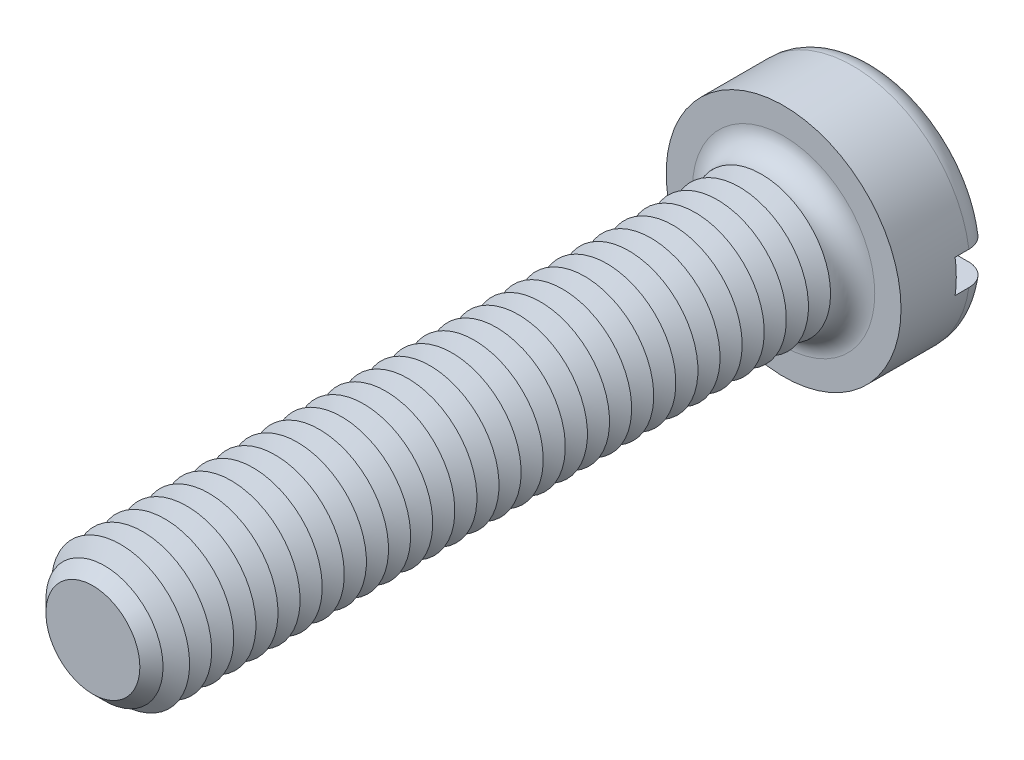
from build123d import *

# Parameters (mm, degrees)
SKETCH3_R           = 4.25
BOSS_EXTRUDE2_DEPTH = 3.3
SKETCH4_R           = 2.5
BOSS_EXTRUDE3_DEPTH = 25
FILLET1_R           = 0.8
CHAMFER1_SIZE       = 0.8
LPATTERN1_COUNT     = 30
LPATTERN1_PITCH     = 0.8
SKETCH8_W           = 8.5
SKETCH8_H           = 1.2
CUT_EXTRUDE1_DEPTH  = 1.3


with BuildPart() as part:
    # Sketch3 → Boss-Extrude2 (new body)
    with BuildSketch(Plane.XY):
        Circle(SKETCH3_R)
    extrude(amount=-BOSS_EXTRUDE2_DEPTH)

    # Sketch4 → Boss-Extrude3 (add)
    with BuildSketch(Plane.XY):
        Circle(SKETCH4_R)
    extrude(amount=BOSS_EXTRUDE3_DEPTH)

    # Fillet1
    fillet1_edges = [part.edges().sort_by_distance(p)[0] for p in [
        (-4.25, 0, -3.3),
        (-2.5, 0, 0),
    ]]
    fillet(fillet1_edges, radius=FILLET1_R)

    # Chamfer1
    chamfer1_edges = [part.edges().sort_by_distance(p)[0] for p in [
        (-2.5, 0, 25),
    ]]
    chamfer(chamfer1_edges, length=CHAMFER1_SIZE)

    # Sketch6 → Cut-Revolve1 (revolve, cut)
    with BuildSketch(Plane(origin=(0, 0, 0), x_dir=(0, 0, -1), z_dir=(1, 0, 0)), mode=Mode.PRIVATE) as cut_revolve1_sk:
        Polygon((-0.8, 2.5), (-1.2, 1.807179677), (-1.6, 2.5), align=None)
    cut_revolve1 = revolve(cut_revolve1_sk.sketch.rotate(Axis((0, 0, -1.694361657), (0, 0, 1)), 90), axis=Axis((0, 0, -1.694361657), (0, 0, 1)), mode=Mode.SUBTRACT)

    # LPattern1: Cut-Revolve1 ×30
    with Locations(*[(0, 0, i * LPATTERN1_PITCH) for i in range(1, LPATTERN1_COUNT)]):
        add(cut_revolve1, mode=Mode.SUBTRACT)

    # Sketch8 → Cut-Extrude1 (cut)
    with BuildSketch(Plane(origin=(0, 0, -3.3), x_dir=(-1, 0, 0), z_dir=(0, 0, -1))):
        Rectangle(SKETCH8_W, SKETCH8_H)
    extrude(amount=-CUT_EXTRUDE1_DEPTH, mode=Mode.SUBTRACT)


solid = part.part
